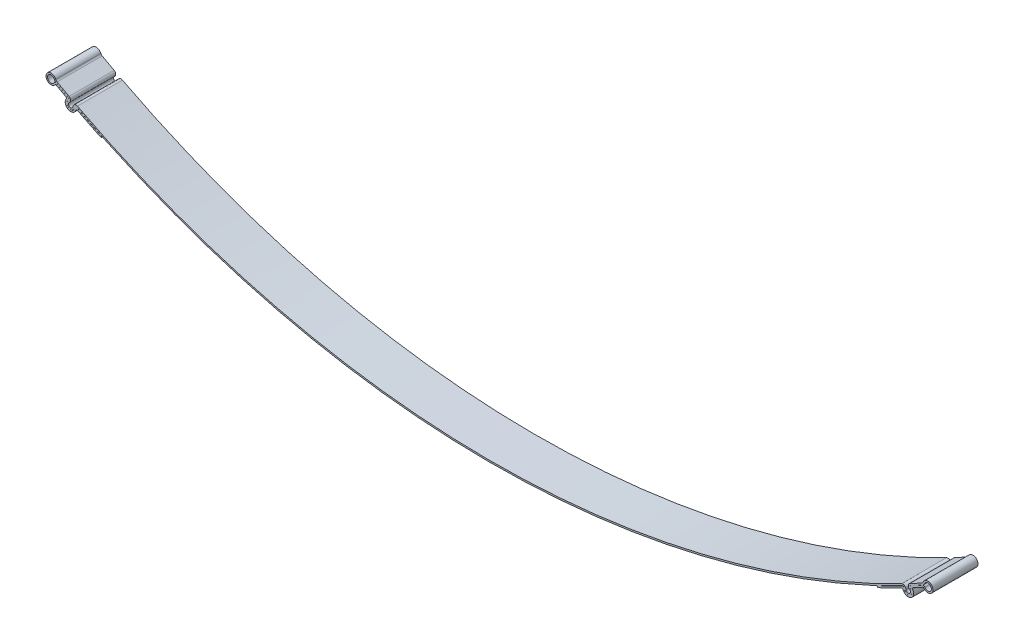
from build123d import *

# Parameters (mm, degrees)
BOSS_EXTRUDE1_DEPTH = 12.7


with BuildPart() as part:
    # Sketch1 → Boss-Extrude1 (new, symmetric)
    with BuildSketch(Plane.XY):
        with BuildLine():
            ThreePointArc((15.014329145, -8.024867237), (21.593519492, -11.35109371), (28.220204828, -14.581661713))
            Line((28.220204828, -14.581661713), (28.603973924, -13.779762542))
            ThreePointArc((28.603973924, -13.779762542), (21.464433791, -10.294079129), (14.380280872, -6.697163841))
            ThreePointArc((14.380280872, -6.697163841), (13.639228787, -6.71971123), (13.268104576, -7.361531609))
            ThreePointArc((13.268104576, -7.361531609), (10.032557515, -9.282879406), (9.772311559, -5.528866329))
            ThreePointArc((9.772311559, -5.528866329), (10.089074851, -4.858547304), (9.686087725, -4.236238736))
            ThreePointArc((9.686087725, -4.236238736), (6.311296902, -2.428167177), (2.95022817, -0.594713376))
            ThreePointArc((2.95022817, -0.594713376), (2.271368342, -0.520107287), (1.73943372, -0.948432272))
            ThreePointArc((1.73943372, -0.948432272), (-1.977654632, 0.118471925), (1.840219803, 0.733992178))
            ThreePointArc((1.840219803, 0.733992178), (2.295908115, -0.006666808), (2.974724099, -0.550207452))
            ThreePointArc((2.974724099, -0.550207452), (6.335456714, -2.383477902), (9.709909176, -4.191370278))
            ThreePointArc((9.709909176, -4.191370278), (10.13976221, -4.855166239), (9.801881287, -5.570173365))
            ThreePointArc((9.801881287, -5.570173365), (10.056144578, -9.23788729), (13.217311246, -7.360708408))
            ThreePointArc((13.217311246, -7.360708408), (13.613177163, -6.676099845), (14.403632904, -6.652049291))
            ThreePointArc((14.403632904, -6.652049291), (21.487077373, -10.248604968), (28.625903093, -13.733940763))
            ThreePointArc((28.625903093, -13.733940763), (135.018373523, -50.799071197), (246.9642, -63.5))
            Line((246.9642, -63.5), (246.965838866, -62.611001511))
            ThreePointArc((246.965838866, -62.611001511), (127.497958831, -48.109530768), (14.812293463, -5.862544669))
            ThreePointArc((14.812293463, -5.862544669), (13.157273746, -5.912900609), (12.328427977, -7.346302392))
            ThreePointArc((12.328427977, -7.346302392), (10.468918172, -8.450525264), (10.31935153, -6.293046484))
            ThreePointArc((10.31935153, -6.293046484), (11.026790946, -4.795996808), (10.126785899, -3.406169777))
            ThreePointArc((10.126785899, -3.406169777), (6.758237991, -1.601444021), (3.40338725, 0.228617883))
            ThreePointArc((3.40338725, 0.228617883), (2.962156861, 0.581919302), (2.665959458, 1.063347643))
            ThreePointArc((2.665959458, 1.063347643), (-2.865063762, 0.171632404), (2.519948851, -1.374010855))
            ThreePointArc((2.519948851, -1.374010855), (2.520658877, -1.373439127), (2.521565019, -1.373538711))
            ThreePointArc((2.521565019, -1.373538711), (5.37256328, -2.930883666), (8.23344509, -4.469996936))
            ThreePointArc((8.23344509, -4.469996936), (8.614795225, -4.961327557), (8.502997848, -5.573156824))
            ThreePointArc((8.502997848, -5.573156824), (9.619783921, -10.070241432), (13.953699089, -8.430680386))
            ThreePointArc((13.953699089, -8.430680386), (14.393308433, -7.990706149), (15.014329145, -8.024867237))
        make_face()
    extrude(amount=BOSS_EXTRUDE1_DEPTH, both=True)

    # Mirror1: part across plane


with BuildPart() as part_1:
    add(part.part)
    add(part.part.mirror(Plane(origin=(247.080422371, -0.455492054, 12.7), x_dir=(0, 0, 1), z_dir=(-0.9999983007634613, 0.0018434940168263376, 0))))


solid = part_1.part
